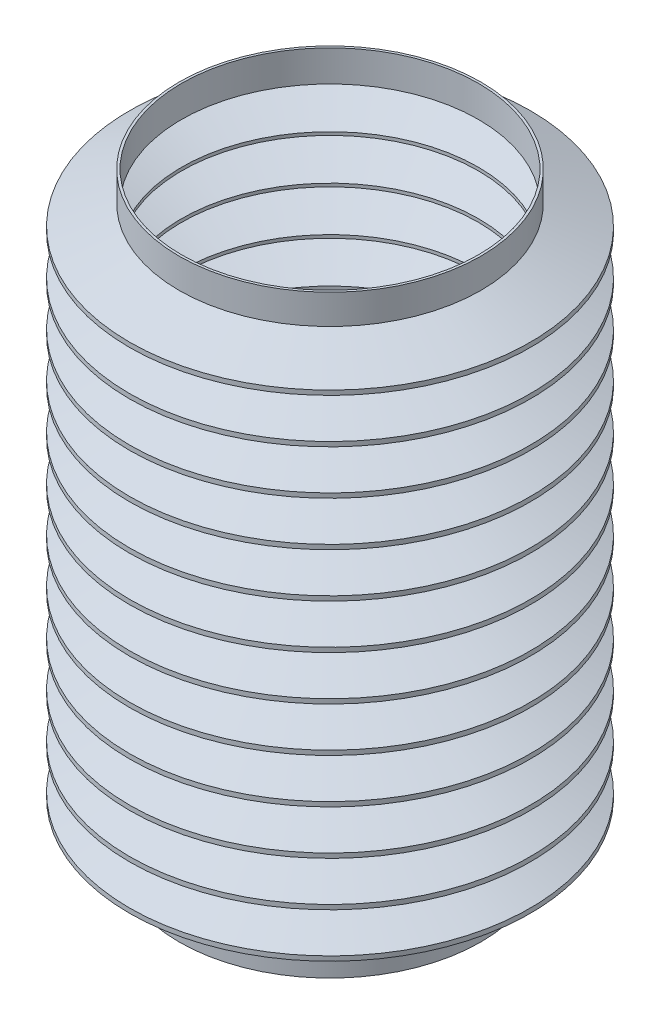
from build123d import *

# Parameters (mm, degrees)
SKETCH11_W = 64.516
SKETCH11_H = 12.7


with BuildPart() as part:
    # Sketch1 → Revolve1 (revolve)
    with BuildSketch(Plane.XY, mode=Mode.PRIVATE) as revolve1_sk:
        Polygon((-64.516, 0), (-63.5, 0), (-63.5, 26.08633882), (-85.465188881, 34.925), (-63.5, 43.76366118), (-63.5, 45.13633882), (-85.465188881, 53.975), (-63.5, 62.81366118), (-63.5, 64.18633882), (-85.465188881, 73.025), (-63.5, 81.86366118), (-63.5, 83.23633882), (-85.465188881, 92.075), (-63.5, 100.91366118), (-63.5, 102.28633882), (-85.465188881, 111.125), (-63.5, 119.96366118), (-63.5, 121.33633882), (-85.465188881, 130.175), (-63.5, 139.01366118), (-63.5, 140.38633882), (-85.465188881, 149.225), (-63.5, 158.06366118), (-63.5, 159.43633882), (-85.465188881, 168.275), (-63.5, 177.11366118), (-63.5, 178.48633882), (-85.465188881, 187.325), (-63.5, 196.16366118), (-63.5, 197.53633882), (-85.465188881, 206.375), (-63.5, 215.21366118), (-63.5, 216.58633882), (-85.465188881, 225.425), (-63.5, 234.26366118), (-63.5, 235.63633882), (-85.465188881, 244.475), (-63.5, 253.31366118), (-63.5, 279.4), (-64.516, 279.4), (-64.516, 254), (-85.725, 245.465624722), (-85.725, 243.484375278), (-64.516, 234.95), (-85.725, 226.415624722), (-85.725, 224.434375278), (-64.516, 215.9), (-85.725, 207.365624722), (-85.725, 205.384375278), (-64.516, 196.85), (-85.725, 188.315624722), (-85.725, 186.334375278), (-64.516, 177.8), (-85.725, 169.265624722), (-85.725, 167.284375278), (-64.516, 158.75), (-85.725, 150.215624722), (-85.725, 148.234375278), (-64.516, 139.7), (-85.725, 131.165624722), (-85.725, 129.184375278), (-64.516, 120.65), (-85.725, 112.115624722), (-85.725, 110.134375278), (-64.516, 101.6), (-85.725, 93.065624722), (-85.725, 91.084375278), (-64.516, 82.55), (-85.725, 74.015624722), (-85.725, 72.034375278), (-64.516, 63.5), (-85.725, 54.965624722), (-85.725, 52.984375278), (-64.516, 44.45), (-85.725, 35.915624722), (-85.725, 33.934375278), (-64.516, 25.4), align=None)
    revolve(revolve1_sk.sketch.rotate(Axis((0, 0, 0), (0, 1, 0)), 270), axis=Axis((0, 0, 0), (0, 1, 0)))

    # Sketch11 → Cut-Revolve1 (revolve, cut)
    with BuildSketch(Plane.XY, mode=Mode.PRIVATE) as cut_revolve1_sk:
        with Locations((-32.258, 273.05)):
            Rectangle(SKETCH11_W, SKETCH11_H)
        with Locations((-32.258, 6.35)):
            Rectangle(SKETCH11_W, SKETCH11_H)
    revolve(cut_revolve1_sk.sketch.rotate(Axis((0, 4.14990993, 0), (0, 1, 0)), 270), axis=Axis((0, 4.14990993, 0), (0, 1, 0)), mode=Mode.SUBTRACT)


solid = part.part
